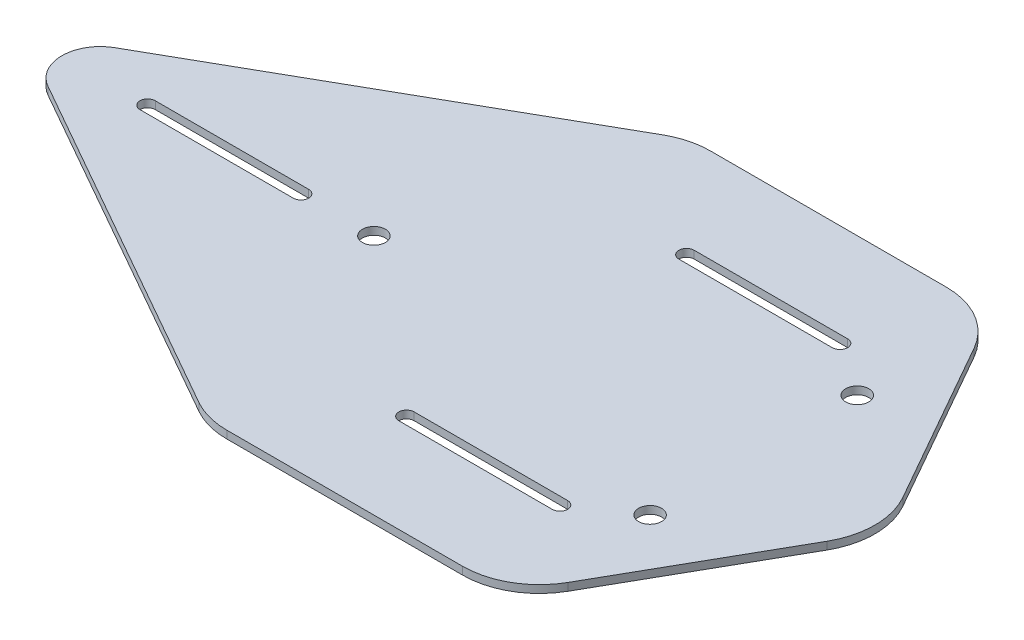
ISO-10303-21;
HEADER;
FILE_DESCRIPTION(('STEP AP214'),'2;1');
FILE_NAME('part.step','',(''),(''),'','','');
FILE_SCHEMA(('AUTOMOTIVE_DESIGN { 1 0 10303 214 1 1 1 1 }'));
ENDSEC;
DATA;
#1=APPLICATION_CONTEXT('core data for automotive mechanical design processes');
#2=APPLICATION_PROTOCOL_DEFINITION('international standard','automotive_design',2000,#1);
#3=PRODUCT_CONTEXT('',#1,'mechanical');
#4=PRODUCT('Part','Part','',(#3));
#5=PRODUCT_RELATED_PRODUCT_CATEGORY('part','',(#4));
#6=PRODUCT_DEFINITION_FORMATION('','',#4);
#7=PRODUCT_DEFINITION_CONTEXT('part definition',#1,'design');
#8=PRODUCT_DEFINITION('design','',#6,#7);
#9=PRODUCT_DEFINITION_SHAPE('','',#8);
#10=(LENGTH_UNIT() NAMED_UNIT(*) SI_UNIT(.MILLI.,.METRE.));
#11=(NAMED_UNIT(*) PLANE_ANGLE_UNIT() SI_UNIT($,.RADIAN.));
#12=(NAMED_UNIT(*) SI_UNIT($,.STERADIAN.) SOLID_ANGLE_UNIT());
#13=UNCERTAINTY_MEASURE_WITH_UNIT(LENGTH_MEASURE(1.E-05),#10,'distance_accuracy_value','');
#14=(GEOMETRIC_REPRESENTATION_CONTEXT(3) GLOBAL_UNCERTAINTY_ASSIGNED_CONTEXT((#13)) GLOBAL_UNIT_ASSIGNED_CONTEXT((#10,
#11,#12)) REPRESENTATION_CONTEXT('',''));
#15=CARTESIAN_POINT('',(0.,0.,0.));
#16=DIRECTION('',(0.,0.,1.));
#17=DIRECTION('',(1.,0.,0.));
#18=AXIS2_PLACEMENT_3D('',#15,#16,#17);
#19=CARTESIAN_POINT('',(-136.345922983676,2.,0.));
#20=DIRECTION('',(0.,1.,0.));
#21=DIRECTION('',(0.,0.,1.));
#22=AXIS2_PLACEMENT_3D('',#19,#20,#21);
#23=PLANE('',#22);
#24=CARTESIAN_POINT('',(34.,2.,27.));
#25=DIRECTION('',(0.,1.,0.));
#26=DIRECTION('',(0.,0.,-1.));
#27=AXIS2_PLACEMENT_3D('',#24,#25,#26);
#28=CIRCLE('',#27,2.99999999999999);
#29=CARTESIAN_POINT('',(34.,2.,24.));
#30=VERTEX_POINT('',#29);
#31=EDGE_CURVE('E706',#30,#30,#28,.T.);
#32=ORIENTED_EDGE('',*,*,#31,.F.);
#33=EDGE_LOOP('',(#32));
#34=FACE_BOUND('',#33,.T.);
#35=DIRECTION('',(1.,0.,0.));
#36=VECTOR('',#35,1.);
#37=CARTESIAN_POINT('',(-124.,2.,2.00000000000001));
#38=LINE('',#37,#36);
#39=CARTESIAN_POINT('',(-124.,2.,2.00000000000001));
#40=VERTEX_POINT('',#39);
#41=CARTESIAN_POINT('',(-84.,2.,2.));
#42=VERTEX_POINT('',#41);
#43=EDGE_CURVE('E202',#40,#42,#38,.T.);
#44=ORIENTED_EDGE('',*,*,#43,.F.);
#45=CARTESIAN_POINT('',(-124.,2.,0.));
#46=DIRECTION('',(0.,1.,0.));
#47=DIRECTION('',(0.,0.,1.));
#48=AXIS2_PLACEMENT_3D('',#45,#46,#47);
#49=CIRCLE('',#48,2.00000000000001);
#50=CARTESIAN_POINT('',(-124.,2.,-2.00000000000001));
#51=VERTEX_POINT('',#50);
#52=EDGE_CURVE('E194',#51,#40,#49,.T.);
#53=ORIENTED_EDGE('',*,*,#52,.F.);
#54=DIRECTION('',(-1.,0.,0.));
#55=VECTOR('',#54,1.);
#56=CARTESIAN_POINT('',(-124.,2.,-2.00000000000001));
#57=LINE('',#56,#55);
#58=CARTESIAN_POINT('',(-84.,2.,-2.00000000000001));
#59=VERTEX_POINT('',#58);
#60=EDGE_CURVE('E217',#59,#51,#57,.T.);
#61=ORIENTED_EDGE('',*,*,#60,.F.);
#62=CARTESIAN_POINT('',(-84.,2.,0.));
#63=DIRECTION('',(0.,1.,0.));
#64=DIRECTION('',(0.,0.,1.));
#65=AXIS2_PLACEMENT_3D('',#62,#63,#64);
#66=CIRCLE('',#65,2.00000000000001);
#67=EDGE_CURVE('E215',#42,#59,#66,.T.);
#68=ORIENTED_EDGE('',*,*,#67,.F.);
#69=EDGE_LOOP('',(#44,#53,#61,#68));
#70=FACE_BOUND('',#69,.T.);
#71=DIRECTION('',(-1.,0.,0.));
#72=VECTOR('',#71,1.);
#73=CARTESIAN_POINT('',(20.,2.,-38.5));
#74=LINE('',#73,#72);
#75=CARTESIAN_POINT('',(20.,2.,-38.5));
#76=VERTEX_POINT('',#75);
#77=CARTESIAN_POINT('',(-20.,2.,-38.5));
#78=VERTEX_POINT('',#77);
#79=EDGE_CURVE('E266',#76,#78,#74,.T.);
#80=ORIENTED_EDGE('',*,*,#79,.F.);
#81=CARTESIAN_POINT('',(20.,2.,-36.5));
#82=DIRECTION('',(0.,1.,0.));
#83=DIRECTION('',(0.,0.,1.));
#84=AXIS2_PLACEMENT_3D('',#81,#82,#83);
#85=CIRCLE('',#84,2.00000000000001);
#86=CARTESIAN_POINT('',(20.,2.,-34.5));
#87=VERTEX_POINT('',#86);
#88=EDGE_CURVE('E264',#87,#76,#85,.T.);
#89=ORIENTED_EDGE('',*,*,#88,.F.);
#90=DIRECTION('',(1.,0.,0.));
#91=VECTOR('',#90,1.);
#92=CARTESIAN_POINT('',(20.,2.,-34.5));
#93=LINE('',#92,#91);
#94=CARTESIAN_POINT('',(-20.,2.,-34.5));
#95=VERTEX_POINT('',#94);
#96=EDGE_CURVE('E272',#95,#87,#93,.T.);
#97=ORIENTED_EDGE('',*,*,#96,.F.);
#98=CARTESIAN_POINT('',(-20.,2.,-36.5));
#99=DIRECTION('',(0.,1.,0.));
#100=DIRECTION('',(0.,0.,1.));
#101=AXIS2_PLACEMENT_3D('',#98,#99,#100);
#102=CIRCLE('',#101,2.00000000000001);
#103=EDGE_CURVE('E269',#78,#95,#102,.T.);
#104=ORIENTED_EDGE('',*,*,#103,.F.);
#105=EDGE_LOOP('',(#80,#89,#97,#104));
#106=FACE_BOUND('',#105,.T.);
#107=CARTESIAN_POINT('',(-136.345922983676,2.,0.));
#108=DIRECTION('',(0.,1.,0.));
#109=DIRECTION('',(0.,0.,1.));
#110=AXIS2_PLACEMENT_3D('',#107,#108,#109);
#111=CIRCLE('',#110,10.);
#112=CARTESIAN_POINT('',(-141.284089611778,2.,-8.69566043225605));
#113=VERTEX_POINT('',#112);
#114=CARTESIAN_POINT('',(-141.284089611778,2.,8.69566043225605));
#115=VERTEX_POINT('',#114);
#116=EDGE_CURVE('E295',#113,#115,#111,.T.);
#117=ORIENTED_EDGE('',*,*,#116,.T.);
#118=DIRECTION('',(0.869566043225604,0.,0.493816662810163));
#119=VECTOR('',#118,1.);
#120=CARTESIAN_POINT('',(-141.284089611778,2.,8.69566043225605));
#121=LINE('',#120,#119);
#122=CARTESIAN_POINT('',(-50.1797595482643,2.,60.4327729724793));
#123=VERTEX_POINT('',#122);
#124=EDGE_CURVE('E298',#115,#123,#121,.T.);
#125=ORIENTED_EDGE('',*,*,#124,.T.);
#126=CARTESIAN_POINT('',(-40.3034262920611,2.,43.0414521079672));
#127=DIRECTION('',(0.,1.,0.));
#128=DIRECTION('',(0.,0.,1.));
#129=AXIS2_PLACEMENT_3D('',#126,#127,#128);
#130=CIRCLE('',#129,20.);
#131=CARTESIAN_POINT('',(-40.3034262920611,2.,63.0414521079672));
#132=VERTEX_POINT('',#131);
#133=EDGE_CURVE('E301',#123,#132,#130,.T.);
#134=ORIENTED_EDGE('',*,*,#133,.T.);
#135=DIRECTION('',(1.,0.,0.));
#136=VECTOR('',#135,1.);
#137=CARTESIAN_POINT('',(-40.3034262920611,2.,63.0414521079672));
#138=LINE('',#137,#136);
#139=CARTESIAN_POINT('',(21.17688950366,2.,63.0414521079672));
#140=VERTEX_POINT('',#139);
#141=EDGE_CURVE('E303',#132,#140,#138,.T.);
#142=ORIENTED_EDGE('',*,*,#141,.T.);
#143=CARTESIAN_POINT('',(21.17688950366,2.,43.0414521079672));
#144=DIRECTION('',(0.,1.,0.));
#145=DIRECTION('',(0.,0.,1.));
#146=AXIS2_PLACEMENT_3D('',#143,#144,#145);
#147=CIRCLE('',#146,20.);
#148=CARTESIAN_POINT('',(38.5682103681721,2.,52.9177853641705));
#149=VERTEX_POINT('',#148);
#150=EDGE_CURVE('E305',#140,#149,#147,.T.);
#151=ORIENTED_EDGE('',*,*,#150,.T.);
#152=DIRECTION('',(0.493816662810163,0.,-0.869566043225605));
#153=VECTOR('',#152,1.);
#154=CARTESIAN_POINT('',(38.5682103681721,2.,52.9177853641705));
#155=LINE('',#154,#153);
#156=CARTESIAN_POINT('',(63.0109613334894,2.,9.87633325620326));
#157=VERTEX_POINT('',#156);
#158=EDGE_CURVE('E307',#149,#157,#155,.T.);
#159=ORIENTED_EDGE('',*,*,#158,.T.);
#160=CARTESIAN_POINT('',(45.6196404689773,2.,0.));
#161=DIRECTION('',(0.,1.,0.));
#162=DIRECTION('',(0.,0.,1.));
#163=AXIS2_PLACEMENT_3D('',#160,#161,#162);
#164=CIRCLE('',#163,20.);
#165=CARTESIAN_POINT('',(63.0109613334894,2.,-9.87633325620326));
#166=VERTEX_POINT('',#165);
#167=EDGE_CURVE('E309',#157,#166,#164,.T.);
#168=ORIENTED_EDGE('',*,*,#167,.T.);
#169=DIRECTION('',(-0.493816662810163,0.,-0.869566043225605));
#170=VECTOR('',#169,1.);
#171=CARTESIAN_POINT('',(63.0109613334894,2.,-9.87633325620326));
#172=LINE('',#171,#170);
#173=CARTESIAN_POINT('',(38.5682103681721,2.,-52.9177853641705));
#174=VERTEX_POINT('',#173);
#175=EDGE_CURVE('E311',#166,#174,#172,.T.);
#176=ORIENTED_EDGE('',*,*,#175,.T.);
#177=CARTESIAN_POINT('',(21.17688950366,2.,-43.0414521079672));
#178=DIRECTION('',(0.,1.,0.));
#179=DIRECTION('',(0.,0.,1.));
#180=AXIS2_PLACEMENT_3D('',#177,#178,#179);
#181=CIRCLE('',#180,20.);
#182=CARTESIAN_POINT('',(21.17688950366,2.,-63.0414521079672));
#183=VERTEX_POINT('',#182);
#184=EDGE_CURVE('E313',#174,#183,#181,.T.);
#185=ORIENTED_EDGE('',*,*,#184,.T.);
#186=DIRECTION('',(-1.,0.,0.));
#187=VECTOR('',#186,1.);
#188=CARTESIAN_POINT('',(21.17688950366,2.,-63.0414521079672));
#189=LINE('',#188,#187);
#190=CARTESIAN_POINT('',(-40.3034262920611,2.,-63.0414521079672));
#191=VERTEX_POINT('',#190);
#192=EDGE_CURVE('E315',#183,#191,#189,.T.);
#193=ORIENTED_EDGE('',*,*,#192,.T.);
#194=CARTESIAN_POINT('',(-40.3034262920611,2.,-43.0414521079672));
#195=DIRECTION('',(0.,1.,0.));
#196=DIRECTION('',(0.,0.,-1.));
#197=AXIS2_PLACEMENT_3D('',#194,#195,#196);
#198=CIRCLE('',#197,20.);
#199=CARTESIAN_POINT('',(-50.1797595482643,2.,-60.4327729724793));
#200=VERTEX_POINT('',#199);
#201=EDGE_CURVE('E317',#191,#200,#198,.T.);
#202=ORIENTED_EDGE('',*,*,#201,.T.);
#203=DIRECTION('',(-0.869566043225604,0.,0.493816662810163));
#204=VECTOR('',#203,1.);
#205=CARTESIAN_POINT('',(-50.1797595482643,2.,-60.4327729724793));
#206=LINE('',#205,#204);
#207=EDGE_CURVE('E319',#200,#113,#206,.T.);
#208=ORIENTED_EDGE('',*,*,#207,.T.);
#209=EDGE_LOOP('',(#117,#125,#134,#142,#151,#159,#168,#176,#185,#193,#202,#208));
#210=FACE_BOUND('',#209,.T.);
#211=DIRECTION('',(-1.,0.,0.));
#212=VECTOR('',#211,1.);
#213=CARTESIAN_POINT('',(20.,2.,34.5));
#214=LINE('',#213,#212);
#215=CARTESIAN_POINT('',(20.,2.,34.5));
#216=VERTEX_POINT('',#215);
#217=CARTESIAN_POINT('',(-20.,2.,34.5));
#218=VERTEX_POINT('',#217);
#219=EDGE_CURVE('E235',#216,#218,#214,.T.);
#220=ORIENTED_EDGE('',*,*,#219,.F.);
#221=CARTESIAN_POINT('',(20.,2.,36.5));
#222=DIRECTION('',(0.,1.,0.));
#223=DIRECTION('',(0.,0.,1.));
#224=AXIS2_PLACEMENT_3D('',#221,#222,#223);
#225=CIRCLE('',#224,2.);
#226=CARTESIAN_POINT('',(20.,2.,38.5));
#227=VERTEX_POINT('',#226);
#228=EDGE_CURVE('E233',#227,#216,#225,.T.);
#229=ORIENTED_EDGE('',*,*,#228,.F.);
#230=DIRECTION('',(1.,0.,0.));
#231=VECTOR('',#230,1.);
#232=CARTESIAN_POINT('',(20.,2.,38.5));
#233=LINE('',#232,#231);
#234=CARTESIAN_POINT('',(-20.,2.,38.5));
#235=VERTEX_POINT('',#234);
#236=EDGE_CURVE('E241',#235,#227,#233,.T.);
#237=ORIENTED_EDGE('',*,*,#236,.F.);
#238=CARTESIAN_POINT('',(-20.,2.,36.5));
#239=DIRECTION('',(0.,1.,0.));
#240=DIRECTION('',(0.,0.,1.));
#241=AXIS2_PLACEMENT_3D('',#238,#239,#240);
#242=CIRCLE('',#241,2.);
#243=EDGE_CURVE('E238',#218,#235,#242,.T.);
#244=ORIENTED_EDGE('',*,*,#243,.F.);
#245=EDGE_LOOP('',(#220,#229,#237,#244));
#246=FACE_BOUND('',#245,.T.);
#247=CARTESIAN_POINT('',(-65.,2.,0.));
#248=DIRECTION('',(0.,1.,0.));
#249=DIRECTION('',(0.,0.,-1.));
#250=AXIS2_PLACEMENT_3D('',#247,#248,#249);
#251=CIRCLE('',#250,3.00000000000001);
#252=CARTESIAN_POINT('',(-65.,2.,-3.00000000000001));
#253=VERTEX_POINT('',#252);
#254=EDGE_CURVE('E223',#253,#253,#251,.T.);
#255=ORIENTED_EDGE('',*,*,#254,.F.);
#256=EDGE_LOOP('',(#255));
#257=FACE_BOUND('',#256,.T.);
#258=CARTESIAN_POINT('',(34.,2.,-27.));
#259=DIRECTION('',(0.,1.,0.));
#260=DIRECTION('',(0.,0.,-1.));
#261=AXIS2_PLACEMENT_3D('',#258,#259,#260);
#262=CIRCLE('',#261,2.99999999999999);
#263=CARTESIAN_POINT('',(34.,2.,-30.));
#264=VERTEX_POINT('',#263);
#265=EDGE_CURVE('E697',#264,#264,#262,.T.);
#266=ORIENTED_EDGE('',*,*,#265,.F.);
#267=EDGE_LOOP('',(#266));
#268=FACE_BOUND('',#267,.T.);
#269=ADVANCED_FACE('F33',(#34,#70,#106,#210,#246,#257,#268),#23,.T.);
#270=CARTESIAN_POINT('',(-136.345922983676,0.,0.));
#271=DIRECTION('',(0.,1.,0.));
#272=DIRECTION('',(0.,0.,1.));
#273=AXIS2_PLACEMENT_3D('',#270,#271,#272);
#274=PLANE('',#273);
#275=CARTESIAN_POINT('',(34.,0.,27.));
#276=DIRECTION('',(0.,1.,0.));
#277=DIRECTION('',(0.,0.,-1.));
#278=AXIS2_PLACEMENT_3D('',#275,#276,#277);
#279=CIRCLE('',#278,2.99999999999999);
#280=CARTESIAN_POINT('',(34.,0.,24.));
#281=VERTEX_POINT('',#280);
#282=EDGE_CURVE('E703',#281,#281,#279,.T.);
#283=ORIENTED_EDGE('',*,*,#282,.T.);
#284=EDGE_LOOP('',(#283));
#285=FACE_BOUND('',#284,.T.);
#286=CARTESIAN_POINT('',(-124.,0.,0.));
#287=DIRECTION('',(0.,1.,0.));
#288=DIRECTION('',(0.,0.,1.));
#289=AXIS2_PLACEMENT_3D('',#286,#287,#288);
#290=CIRCLE('',#289,2.00000000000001);
#291=CARTESIAN_POINT('',(-124.,0.,-2.00000000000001));
#292=VERTEX_POINT('',#291);
#293=CARTESIAN_POINT('',(-124.,0.,2.00000000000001));
#294=VERTEX_POINT('',#293);
#295=EDGE_CURVE('E56',#292,#294,#290,.T.);
#296=ORIENTED_EDGE('',*,*,#295,.T.);
#297=DIRECTION('',(1.,0.,0.));
#298=VECTOR('',#297,1.);
#299=CARTESIAN_POINT('',(-124.,0.,2.00000000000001));
#300=LINE('',#299,#298);
#301=CARTESIAN_POINT('',(-84.,0.,2.));
#302=VERTEX_POINT('',#301);
#303=EDGE_CURVE('E209',#294,#302,#300,.T.);
#304=ORIENTED_EDGE('',*,*,#303,.T.);
#305=CARTESIAN_POINT('',(-84.,0.,0.));
#306=DIRECTION('',(0.,1.,0.));
#307=DIRECTION('',(0.,0.,1.));
#308=AXIS2_PLACEMENT_3D('',#305,#306,#307);
#309=CIRCLE('',#308,2.00000000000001);
#310=CARTESIAN_POINT('',(-84.,0.,-2.00000000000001));
#311=VERTEX_POINT('',#310);
#312=EDGE_CURVE('E225',#302,#311,#309,.T.);
#313=ORIENTED_EDGE('',*,*,#312,.T.);
#314=DIRECTION('',(-1.,0.,0.));
#315=VECTOR('',#314,1.);
#316=CARTESIAN_POINT('',(-124.,0.,-2.00000000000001));
#317=LINE('',#316,#315);
#318=EDGE_CURVE('E203',#311,#292,#317,.T.);
#319=ORIENTED_EDGE('',*,*,#318,.T.);
#320=EDGE_LOOP('',(#296,#304,#313,#319));
#321=FACE_BOUND('',#320,.T.);
#322=CARTESIAN_POINT('',(20.,0.,-36.5));
#323=DIRECTION('',(0.,1.,0.));
#324=DIRECTION('',(0.,0.,1.));
#325=AXIS2_PLACEMENT_3D('',#322,#323,#324);
#326=CIRCLE('',#325,2.00000000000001);
#327=CARTESIAN_POINT('',(20.,0.,-34.5));
#328=VERTEX_POINT('',#327);
#329=CARTESIAN_POINT('',(20.,0.,-38.5));
#330=VERTEX_POINT('',#329);
#331=EDGE_CURVE('E263',#328,#330,#326,.T.);
#332=ORIENTED_EDGE('',*,*,#331,.T.);
#333=DIRECTION('',(-1.,0.,0.));
#334=VECTOR('',#333,1.);
#335=CARTESIAN_POINT('',(20.,0.,-38.5));
#336=LINE('',#335,#334);
#337=CARTESIAN_POINT('',(-20.,0.,-38.5));
#338=VERTEX_POINT('',#337);
#339=EDGE_CURVE('E277',#330,#338,#336,.T.);
#340=ORIENTED_EDGE('',*,*,#339,.T.);
#341=CARTESIAN_POINT('',(-20.,0.,-36.5));
#342=DIRECTION('',(0.,1.,0.));
#343=DIRECTION('',(0.,0.,1.));
#344=AXIS2_PLACEMENT_3D('',#341,#342,#343);
#345=CIRCLE('',#344,2.00000000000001);
#346=CARTESIAN_POINT('',(-20.,0.,-34.5));
#347=VERTEX_POINT('',#346);
#348=EDGE_CURVE('E280',#338,#347,#345,.T.);
#349=ORIENTED_EDGE('',*,*,#348,.T.);
#350=DIRECTION('',(1.,0.,0.));
#351=VECTOR('',#350,1.);
#352=CARTESIAN_POINT('',(20.,0.,-34.5));
#353=LINE('',#352,#351);
#354=EDGE_CURVE('E267',#347,#328,#353,.T.);
#355=ORIENTED_EDGE('',*,*,#354,.T.);
#356=EDGE_LOOP('',(#332,#340,#349,#355));
#357=FACE_BOUND('',#356,.T.);
#358=CARTESIAN_POINT('',(-136.345922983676,0.,0.));
#359=DIRECTION('',(0.,1.,0.));
#360=DIRECTION('',(0.,0.,1.));
#361=AXIS2_PLACEMENT_3D('',#358,#359,#360);
#362=CIRCLE('',#361,10.);
#363=CARTESIAN_POINT('',(-141.284089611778,0.,-8.69566043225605));
#364=VERTEX_POINT('',#363);
#365=CARTESIAN_POINT('',(-141.284089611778,0.,8.69566043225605));
#366=VERTEX_POINT('',#365);
#367=EDGE_CURVE('E294',#364,#366,#362,.T.);
#368=ORIENTED_EDGE('',*,*,#367,.F.);
#369=DIRECTION('',(-0.869566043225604,0.,0.493816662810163));
#370=VECTOR('',#369,1.);
#371=CARTESIAN_POINT('',(-50.1797595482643,0.,-60.4327729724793));
#372=LINE('',#371,#370);
#373=CARTESIAN_POINT('',(-50.1797595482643,0.,-60.4327729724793));
#374=VERTEX_POINT('',#373);
#375=EDGE_CURVE('E299',#374,#364,#372,.T.);
#376=ORIENTED_EDGE('',*,*,#375,.F.);
#377=CARTESIAN_POINT('',(-40.3034262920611,0.,-43.0414521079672));
#378=DIRECTION('',(0.,1.,0.));
#379=DIRECTION('',(0.,0.,-1.));
#380=AXIS2_PLACEMENT_3D('',#377,#378,#379);
#381=CIRCLE('',#380,20.);
#382=CARTESIAN_POINT('',(-40.3034262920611,0.,-63.0414521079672));
#383=VERTEX_POINT('',#382);
#384=EDGE_CURVE('E342',#383,#374,#381,.T.);
#385=ORIENTED_EDGE('',*,*,#384,.F.);
#386=DIRECTION('',(-1.,0.,0.));
#387=VECTOR('',#386,1.);
#388=CARTESIAN_POINT('',(21.17688950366,0.,-63.0414521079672));
#389=LINE('',#388,#387);
#390=CARTESIAN_POINT('',(21.17688950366,0.,-63.0414521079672));
#391=VERTEX_POINT('',#390);
#392=EDGE_CURVE('E340',#391,#383,#389,.T.);
#393=ORIENTED_EDGE('',*,*,#392,.F.);
#394=CARTESIAN_POINT('',(21.17688950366,0.,-43.0414521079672));
#395=DIRECTION('',(0.,1.,0.));
#396=DIRECTION('',(0.,0.,1.));
#397=AXIS2_PLACEMENT_3D('',#394,#395,#396);
#398=CIRCLE('',#397,20.);
#399=CARTESIAN_POINT('',(38.5682103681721,0.,-52.9177853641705));
#400=VERTEX_POINT('',#399);
#401=EDGE_CURVE('E338',#400,#391,#398,.T.);
#402=ORIENTED_EDGE('',*,*,#401,.F.);
#403=DIRECTION('',(-0.493816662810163,0.,-0.869566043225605));
#404=VECTOR('',#403,1.);
#405=CARTESIAN_POINT('',(63.0109613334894,0.,-9.87633325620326));
#406=LINE('',#405,#404);
#407=CARTESIAN_POINT('',(63.0109613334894,0.,-9.87633325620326));
#408=VERTEX_POINT('',#407);
#409=EDGE_CURVE('E336',#408,#400,#406,.T.);
#410=ORIENTED_EDGE('',*,*,#409,.F.);
#411=CARTESIAN_POINT('',(45.6196404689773,0.,0.));
#412=DIRECTION('',(0.,1.,0.));
#413=DIRECTION('',(0.,0.,1.));
#414=AXIS2_PLACEMENT_3D('',#411,#412,#413);
#415=CIRCLE('',#414,20.);
#416=CARTESIAN_POINT('',(63.0109613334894,0.,9.87633325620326));
#417=VERTEX_POINT('',#416);
#418=EDGE_CURVE('E334',#417,#408,#415,.T.);
#419=ORIENTED_EDGE('',*,*,#418,.F.);
#420=DIRECTION('',(0.493816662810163,0.,-0.869566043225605));
#421=VECTOR('',#420,1.);
#422=CARTESIAN_POINT('',(38.5682103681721,0.,52.9177853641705));
#423=LINE('',#422,#421);
#424=CARTESIAN_POINT('',(38.5682103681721,0.,52.9177853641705));
#425=VERTEX_POINT('',#424);
#426=EDGE_CURVE('E332',#425,#417,#423,.T.);
#427=ORIENTED_EDGE('',*,*,#426,.F.);
#428=CARTESIAN_POINT('',(21.17688950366,0.,43.0414521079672));
#429=DIRECTION('',(0.,1.,0.));
#430=DIRECTION('',(0.,0.,1.));
#431=AXIS2_PLACEMENT_3D('',#428,#429,#430);
#432=CIRCLE('',#431,20.);
#433=CARTESIAN_POINT('',(21.17688950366,0.,63.0414521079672));
#434=VERTEX_POINT('',#433);
#435=EDGE_CURVE('E330',#434,#425,#432,.T.);
#436=ORIENTED_EDGE('',*,*,#435,.F.);
#437=DIRECTION('',(1.,0.,0.));
#438=VECTOR('',#437,1.);
#439=CARTESIAN_POINT('',(-40.3034262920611,0.,63.0414521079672));
#440=LINE('',#439,#438);
#441=CARTESIAN_POINT('',(-40.3034262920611,0.,63.0414521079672));
#442=VERTEX_POINT('',#441);
#443=EDGE_CURVE('E328',#442,#434,#440,.T.);
#444=ORIENTED_EDGE('',*,*,#443,.F.);
#445=CARTESIAN_POINT('',(-40.3034262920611,0.,43.0414521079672));
#446=DIRECTION('',(0.,1.,0.));
#447=DIRECTION('',(0.,0.,1.));
#448=AXIS2_PLACEMENT_3D('',#445,#446,#447);
#449=CIRCLE('',#448,20.);
#450=CARTESIAN_POINT('',(-50.1797595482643,0.,60.4327729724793));
#451=VERTEX_POINT('',#450);
#452=EDGE_CURVE('E326',#451,#442,#449,.T.);
#453=ORIENTED_EDGE('',*,*,#452,.F.);
#454=DIRECTION('',(0.869566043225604,0.,0.493816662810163));
#455=VECTOR('',#454,1.);
#456=CARTESIAN_POINT('',(-141.284089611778,0.,8.69566043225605));
#457=LINE('',#456,#455);
#458=EDGE_CURVE('E324',#366,#451,#457,.T.);
#459=ORIENTED_EDGE('',*,*,#458,.F.);
#460=EDGE_LOOP('',(#368,#376,#385,#393,#402,#410,#419,#427,#436,#444,#453,#459));
#461=FACE_BOUND('',#460,.T.);
#462=CARTESIAN_POINT('',(20.,0.,36.5));
#463=DIRECTION('',(0.,1.,0.));
#464=DIRECTION('',(0.,0.,1.));
#465=AXIS2_PLACEMENT_3D('',#462,#463,#464);
#466=CIRCLE('',#465,2.);
#467=CARTESIAN_POINT('',(20.,0.,38.5));
#468=VERTEX_POINT('',#467);
#469=CARTESIAN_POINT('',(20.,0.,34.5));
#470=VERTEX_POINT('',#469);
#471=EDGE_CURVE('E210',#468,#470,#466,.T.);
#472=ORIENTED_EDGE('',*,*,#471,.T.);
#473=DIRECTION('',(-1.,0.,0.));
#474=VECTOR('',#473,1.);
#475=CARTESIAN_POINT('',(20.,0.,34.5));
#476=LINE('',#475,#474);
#477=CARTESIAN_POINT('',(-20.,0.,34.5));
#478=VERTEX_POINT('',#477);
#479=EDGE_CURVE('E246',#470,#478,#476,.T.);
#480=ORIENTED_EDGE('',*,*,#479,.T.);
#481=CARTESIAN_POINT('',(-20.,0.,36.5));
#482=DIRECTION('',(0.,1.,0.));
#483=DIRECTION('',(0.,0.,1.));
#484=AXIS2_PLACEMENT_3D('',#481,#482,#483);
#485=CIRCLE('',#484,2.);
#486=CARTESIAN_POINT('',(-20.,0.,38.5));
#487=VERTEX_POINT('',#486);
#488=EDGE_CURVE('E249',#478,#487,#485,.T.);
#489=ORIENTED_EDGE('',*,*,#488,.T.);
#490=DIRECTION('',(1.,0.,0.));
#491=VECTOR('',#490,1.);
#492=CARTESIAN_POINT('',(20.,0.,38.5));
#493=LINE('',#492,#491);
#494=EDGE_CURVE('E236',#487,#468,#493,.T.);
#495=ORIENTED_EDGE('',*,*,#494,.T.);
#496=EDGE_LOOP('',(#472,#480,#489,#495));
#497=FACE_BOUND('',#496,.T.);
#498=CARTESIAN_POINT('',(-65.,0.,0.));
#499=DIRECTION('',(0.,1.,0.));
#500=DIRECTION('',(0.,0.,-1.));
#501=AXIS2_PLACEMENT_3D('',#498,#499,#500);
#502=CIRCLE('',#501,3.00000000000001);
#503=CARTESIAN_POINT('',(-65.,0.,-3.00000000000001));
#504=VERTEX_POINT('',#503);
#505=EDGE_CURVE('E709',#504,#504,#502,.T.);
#506=ORIENTED_EDGE('',*,*,#505,.T.);
#507=EDGE_LOOP('',(#506));
#508=FACE_BOUND('',#507,.T.);
#509=CARTESIAN_POINT('',(34.,0.,-27.));
#510=DIRECTION('',(0.,1.,0.));
#511=DIRECTION('',(0.,0.,-1.));
#512=AXIS2_PLACEMENT_3D('',#509,#510,#511);
#513=CIRCLE('',#512,2.99999999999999);
#514=CARTESIAN_POINT('',(34.,0.,-30.));
#515=VERTEX_POINT('',#514);
#516=EDGE_CURVE('E700',#515,#515,#513,.T.);
#517=ORIENTED_EDGE('',*,*,#516,.T.);
#518=EDGE_LOOP('',(#517));
#519=FACE_BOUND('',#518,.T.);
#520=ADVANCED_FACE('F384',(#285,#321,#357,#461,#497,#508,#519),#274,.F.);
#521=CARTESIAN_POINT('',(-136.345922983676,2.,0.));
#522=DIRECTION('',(0.,-1.,0.));
#523=DIRECTION('',(0.,0.,-1.));
#524=AXIS2_PLACEMENT_3D('',#521,#522,#523);
#525=CYLINDRICAL_SURFACE('',#524,10.);
#526=ORIENTED_EDGE('',*,*,#367,.T.);
#527=DIRECTION('',(0.,-1.,0.));
#528=VECTOR('',#527,1.);
#529=CARTESIAN_POINT('',(-141.284089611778,2.,8.69566043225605));
#530=LINE('',#529,#528);
#531=EDGE_CURVE('E11',#115,#366,#530,.T.);
#532=ORIENTED_EDGE('',*,*,#531,.F.);
#533=ORIENTED_EDGE('',*,*,#116,.F.);
#534=DIRECTION('',(0.,-1.,0.));
#535=VECTOR('',#534,1.);
#536=CARTESIAN_POINT('',(-141.284089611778,2.,-8.69566043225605));
#537=LINE('',#536,#535);
#538=EDGE_CURVE('E321',#113,#364,#537,.T.);
#539=ORIENTED_EDGE('',*,*,#538,.T.);
#540=EDGE_LOOP('',(#526,#532,#533,#539));
#541=FACE_BOUND('',#540,.T.);
#542=ADVANCED_FACE('F35',(#541),#525,.T.);
#543=CARTESIAN_POINT('',(-141.284089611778,2.,8.69566043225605));
#544=DIRECTION('',(0.493816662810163,0.,-0.869566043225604));
#545=DIRECTION('',(-0.869566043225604,0.,-0.493816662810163));
#546=AXIS2_PLACEMENT_3D('',#543,#544,#545);
#547=PLANE('',#546);
#548=ORIENTED_EDGE('',*,*,#458,.T.);
#549=DIRECTION('',(0.,-1.,0.));
#550=VECTOR('',#549,1.);
#551=CARTESIAN_POINT('',(-50.1797595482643,2.,60.4327729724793));
#552=LINE('',#551,#550);
#553=EDGE_CURVE('E41',#123,#451,#552,.T.);
#554=ORIENTED_EDGE('',*,*,#553,.F.);
#555=ORIENTED_EDGE('',*,*,#124,.F.);
#556=ORIENTED_EDGE('',*,*,#531,.T.);
#557=EDGE_LOOP('',(#548,#554,#555,#556));
#558=FACE_BOUND('',#557,.T.);
#559=ADVANCED_FACE('F402',(#558),#547,.F.);
#560=CARTESIAN_POINT('',(-40.3034262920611,2.,43.0414521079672));
#561=DIRECTION('',(0.,-1.,0.));
#562=DIRECTION('',(0.,0.,-1.));
#563=AXIS2_PLACEMENT_3D('',#560,#561,#562);
#564=CYLINDRICAL_SURFACE('',#563,20.);
#565=ORIENTED_EDGE('',*,*,#452,.T.);
#566=DIRECTION('',(0.,-1.,0.));
#567=VECTOR('',#566,1.);
#568=CARTESIAN_POINT('',(-40.3034262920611,2.,63.0414521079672));
#569=LINE('',#568,#567);
#570=EDGE_CURVE('E371',#132,#442,#569,.T.);
#571=ORIENTED_EDGE('',*,*,#570,.F.);
#572=ORIENTED_EDGE('',*,*,#133,.F.);
#573=ORIENTED_EDGE('',*,*,#553,.T.);
#574=EDGE_LOOP('',(#565,#571,#572,#573));
#575=FACE_BOUND('',#574,.T.);
#576=ADVANCED_FACE('F378',(#575),#564,.T.);
#577=CARTESIAN_POINT('',(-40.3034262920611,2.,63.0414521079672));
#578=DIRECTION('',(0.,0.,-1.));
#579=DIRECTION('',(-1.,0.,0.));
#580=AXIS2_PLACEMENT_3D('',#577,#578,#579);
#581=PLANE('',#580);
#582=ORIENTED_EDGE('',*,*,#443,.T.);
#583=DIRECTION('',(0.,-1.,0.));
#584=VECTOR('',#583,1.);
#585=CARTESIAN_POINT('',(21.17688950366,2.,63.0414521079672));
#586=LINE('',#585,#584);
#587=EDGE_CURVE('E368',#140,#434,#586,.T.);
#588=ORIENTED_EDGE('',*,*,#587,.F.);
#589=ORIENTED_EDGE('',*,*,#141,.F.);
#590=ORIENTED_EDGE('',*,*,#570,.T.);
#591=EDGE_LOOP('',(#582,#588,#589,#590));
#592=FACE_BOUND('',#591,.T.);
#593=ADVANCED_FACE('F390',(#592),#581,.F.);
#594=CARTESIAN_POINT('',(21.17688950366,2.,43.0414521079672));
#595=DIRECTION('',(0.,-1.,0.));
#596=DIRECTION('',(0.,0.,-1.));
#597=AXIS2_PLACEMENT_3D('',#594,#595,#596);
#598=CYLINDRICAL_SURFACE('',#597,20.);
#599=ORIENTED_EDGE('',*,*,#435,.T.);
#600=DIRECTION('',(0.,-1.,0.));
#601=VECTOR('',#600,1.);
#602=CARTESIAN_POINT('',(38.5682103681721,2.,52.9177853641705));
#603=LINE('',#602,#601);
#604=EDGE_CURVE('E365',#149,#425,#603,.T.);
#605=ORIENTED_EDGE('',*,*,#604,.F.);
#606=ORIENTED_EDGE('',*,*,#150,.F.);
#607=ORIENTED_EDGE('',*,*,#587,.T.);
#608=EDGE_LOOP('',(#599,#605,#606,#607));
#609=FACE_BOUND('',#608,.T.);
#610=ADVANCED_FACE('F394',(#609),#598,.T.);
#611=CARTESIAN_POINT('',(38.5682103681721,2.,52.9177853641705));
#612=DIRECTION('',(-0.869566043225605,0.,-0.493816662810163));
#613=DIRECTION('',(-0.493816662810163,0.,0.869566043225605));
#614=AXIS2_PLACEMENT_3D('',#611,#612,#613);
#615=PLANE('',#614);
#616=ORIENTED_EDGE('',*,*,#426,.T.);
#617=DIRECTION('',(0.,-1.,0.));
#618=VECTOR('',#617,1.);
#619=CARTESIAN_POINT('',(63.0109613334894,2.,9.87633325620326));
#620=LINE('',#619,#618);
#621=EDGE_CURVE('E362',#157,#417,#620,.T.);
#622=ORIENTED_EDGE('',*,*,#621,.F.);
#623=ORIENTED_EDGE('',*,*,#158,.F.);
#624=ORIENTED_EDGE('',*,*,#604,.T.);
#625=EDGE_LOOP('',(#616,#622,#623,#624));
#626=FACE_BOUND('',#625,.T.);
#627=ADVANCED_FACE('F435',(#626),#615,.F.);
#628=CARTESIAN_POINT('',(45.6196404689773,2.,0.));
#629=DIRECTION('',(0.,-1.,0.));
#630=DIRECTION('',(0.,0.,-1.));
#631=AXIS2_PLACEMENT_3D('',#628,#629,#630);
#632=CYLINDRICAL_SURFACE('',#631,20.);
#633=ORIENTED_EDGE('',*,*,#418,.T.);
#634=DIRECTION('',(0.,-1.,0.));
#635=VECTOR('',#634,1.);
#636=CARTESIAN_POINT('',(63.0109613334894,2.,-9.87633325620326));
#637=LINE('',#636,#635);
#638=EDGE_CURVE('E359',#166,#408,#637,.T.);
#639=ORIENTED_EDGE('',*,*,#638,.F.);
#640=ORIENTED_EDGE('',*,*,#167,.F.);
#641=ORIENTED_EDGE('',*,*,#621,.T.);
#642=EDGE_LOOP('',(#633,#639,#640,#641));
#643=FACE_BOUND('',#642,.T.);
#644=ADVANCED_FACE('F433',(#643),#632,.T.);
#645=CARTESIAN_POINT('',(63.0109613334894,2.,-9.87633325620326));
#646=DIRECTION('',(-0.869566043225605,0.,0.493816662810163));
#647=DIRECTION('',(0.493816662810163,0.,0.869566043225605));
#648=AXIS2_PLACEMENT_3D('',#645,#646,#647);
#649=PLANE('',#648);
#650=ORIENTED_EDGE('',*,*,#409,.T.);
#651=DIRECTION('',(0.,-1.,0.));
#652=VECTOR('',#651,1.);
#653=CARTESIAN_POINT('',(38.5682103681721,2.,-52.9177853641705));
#654=LINE('',#653,#652);
#655=EDGE_CURVE('E356',#174,#400,#654,.T.);
#656=ORIENTED_EDGE('',*,*,#655,.F.);
#657=ORIENTED_EDGE('',*,*,#175,.F.);
#658=ORIENTED_EDGE('',*,*,#638,.T.);
#659=EDGE_LOOP('',(#650,#656,#657,#658));
#660=FACE_BOUND('',#659,.T.);
#661=ADVANCED_FACE('F429',(#660),#649,.F.);
#662=CARTESIAN_POINT('',(21.17688950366,2.,-43.0414521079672));
#663=DIRECTION('',(0.,-1.,0.));
#664=DIRECTION('',(0.,0.,-1.));
#665=AXIS2_PLACEMENT_3D('',#662,#663,#664);
#666=CYLINDRICAL_SURFACE('',#665,20.);
#667=ORIENTED_EDGE('',*,*,#401,.T.);
#668=DIRECTION('',(0.,-1.,0.));
#669=VECTOR('',#668,1.);
#670=CARTESIAN_POINT('',(21.17688950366,2.,-63.0414521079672));
#671=LINE('',#670,#669);
#672=EDGE_CURVE('E353',#183,#391,#671,.T.);
#673=ORIENTED_EDGE('',*,*,#672,.F.);
#674=ORIENTED_EDGE('',*,*,#184,.F.);
#675=ORIENTED_EDGE('',*,*,#655,.T.);
#676=EDGE_LOOP('',(#667,#673,#674,#675));
#677=FACE_BOUND('',#676,.T.);
#678=ADVANCED_FACE('F424',(#677),#666,.T.);
#679=CARTESIAN_POINT('',(21.17688950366,2.,-63.0414521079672));
#680=DIRECTION('',(0.,0.,1.));
#681=DIRECTION('',(1.,0.,0.));
#682=AXIS2_PLACEMENT_3D('',#679,#680,#681);
#683=PLANE('',#682);
#684=ORIENTED_EDGE('',*,*,#392,.T.);
#685=DIRECTION('',(0.,-1.,0.));
#686=VECTOR('',#685,1.);
#687=CARTESIAN_POINT('',(-40.3034262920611,2.,-63.0414521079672));
#688=LINE('',#687,#686);
#689=EDGE_CURVE('E350',#191,#383,#688,.T.);
#690=ORIENTED_EDGE('',*,*,#689,.F.);
#691=ORIENTED_EDGE('',*,*,#192,.F.);
#692=ORIENTED_EDGE('',*,*,#672,.T.);
#693=EDGE_LOOP('',(#684,#690,#691,#692));
#694=FACE_BOUND('',#693,.T.);
#695=ADVANCED_FACE('F418',(#694),#683,.F.);
#696=CARTESIAN_POINT('',(-40.3034262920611,2.,-43.0414521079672));
#697=DIRECTION('',(0.,-1.,0.));
#698=DIRECTION('',(0.,0.,-1.));
#699=AXIS2_PLACEMENT_3D('',#696,#697,#698);
#700=CYLINDRICAL_SURFACE('',#699,20.);
#701=ORIENTED_EDGE('',*,*,#384,.T.);
#702=DIRECTION('',(0.,-1.,0.));
#703=VECTOR('',#702,1.);
#704=CARTESIAN_POINT('',(-50.1797595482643,2.,-60.4327729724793));
#705=LINE('',#704,#703);
#706=EDGE_CURVE('E347',#200,#374,#705,.T.);
#707=ORIENTED_EDGE('',*,*,#706,.F.);
#708=ORIENTED_EDGE('',*,*,#201,.F.);
#709=ORIENTED_EDGE('',*,*,#689,.T.);
#710=EDGE_LOOP('',(#701,#707,#708,#709));
#711=FACE_BOUND('',#710,.T.);
#712=ADVANCED_FACE('F414',(#711),#700,.T.);
#713=CARTESIAN_POINT('',(-50.1797595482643,2.,-60.4327729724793));
#714=DIRECTION('',(0.493816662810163,0.,0.869566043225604));
#715=DIRECTION('',(0.869566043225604,0.,-0.493816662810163));
#716=AXIS2_PLACEMENT_3D('',#713,#714,#715);
#717=PLANE('',#716);
#718=ORIENTED_EDGE('',*,*,#375,.T.);
#719=ORIENTED_EDGE('',*,*,#538,.F.);
#720=ORIENTED_EDGE('',*,*,#207,.F.);
#721=ORIENTED_EDGE('',*,*,#706,.T.);
#722=EDGE_LOOP('',(#718,#719,#720,#721));
#723=FACE_BOUND('',#722,.T.);
#724=ADVANCED_FACE('F409',(#723),#717,.F.);
#725=CARTESIAN_POINT('',(20.,2.,-36.5));
#726=DIRECTION('',(0.,-1.,0.));
#727=DIRECTION('',(0.,0.,-1.));
#728=AXIS2_PLACEMENT_3D('',#725,#726,#727);
#729=CYLINDRICAL_SURFACE('',#728,2.00000000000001);
#730=ORIENTED_EDGE('',*,*,#331,.F.);
#731=DIRECTION('',(0.,-1.,0.));
#732=VECTOR('',#731,1.);
#733=CARTESIAN_POINT('',(20.,2.,-34.5));
#734=LINE('',#733,#732);
#735=EDGE_CURVE('E274',#87,#328,#734,.T.);
#736=ORIENTED_EDGE('',*,*,#735,.F.);
#737=ORIENTED_EDGE('',*,*,#88,.T.);
#738=DIRECTION('',(0.,-1.,0.));
#739=VECTOR('',#738,1.);
#740=CARTESIAN_POINT('',(20.,2.,-38.5));
#741=LINE('',#740,#739);
#742=EDGE_CURVE('E291',#76,#330,#741,.T.);
#743=ORIENTED_EDGE('',*,*,#742,.T.);
#744=EDGE_LOOP('',(#730,#736,#737,#743));
#745=FACE_BOUND('',#744,.T.);
#746=ADVANCED_FACE('F454',(#745),#729,.F.);
#747=CARTESIAN_POINT('',(20.,2.,-38.5));
#748=DIRECTION('',(0.,0.,1.));
#749=DIRECTION('',(1.,0.,0.));
#750=AXIS2_PLACEMENT_3D('',#747,#748,#749);
#751=PLANE('',#750);
#752=ORIENTED_EDGE('',*,*,#339,.F.);
#753=ORIENTED_EDGE('',*,*,#742,.F.);
#754=ORIENTED_EDGE('',*,*,#79,.T.);
#755=DIRECTION('',(0.,-1.,0.));
#756=VECTOR('',#755,1.);
#757=CARTESIAN_POINT('',(-20.,2.,-38.5));
#758=LINE('',#757,#756);
#759=EDGE_CURVE('E289',#78,#338,#758,.T.);
#760=ORIENTED_EDGE('',*,*,#759,.T.);
#761=EDGE_LOOP('',(#752,#753,#754,#760));
#762=FACE_BOUND('',#761,.T.);
#763=ADVANCED_FACE('F492',(#762),#751,.T.);
#764=CARTESIAN_POINT('',(-20.,2.,-36.5));
#765=DIRECTION('',(0.,-1.,0.));
#766=DIRECTION('',(0.,0.,-1.));
#767=AXIS2_PLACEMENT_3D('',#764,#765,#766);
#768=CYLINDRICAL_SURFACE('',#767,2.00000000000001);
#769=ORIENTED_EDGE('',*,*,#348,.F.);
#770=ORIENTED_EDGE('',*,*,#759,.F.);
#771=ORIENTED_EDGE('',*,*,#103,.T.);
#772=DIRECTION('',(0.,-1.,0.));
#773=VECTOR('',#772,1.);
#774=CARTESIAN_POINT('',(-20.,2.,-34.5));
#775=LINE('',#774,#773);
#776=EDGE_CURVE('E287',#95,#347,#775,.T.);
#777=ORIENTED_EDGE('',*,*,#776,.T.);
#778=EDGE_LOOP('',(#769,#770,#771,#777));
#779=FACE_BOUND('',#778,.T.);
#780=ADVANCED_FACE('F499',(#779),#768,.F.);
#781=CARTESIAN_POINT('',(20.,2.,-34.5));
#782=DIRECTION('',(0.,0.,-1.));
#783=DIRECTION('',(-1.,0.,0.));
#784=AXIS2_PLACEMENT_3D('',#781,#782,#783);
#785=PLANE('',#784);
#786=ORIENTED_EDGE('',*,*,#354,.F.);
#787=ORIENTED_EDGE('',*,*,#776,.F.);
#788=ORIENTED_EDGE('',*,*,#96,.T.);
#789=ORIENTED_EDGE('',*,*,#735,.T.);
#790=EDGE_LOOP('',(#786,#787,#788,#789));
#791=FACE_BOUND('',#790,.T.);
#792=ADVANCED_FACE('F506',(#791),#785,.T.);
#793=CARTESIAN_POINT('',(20.,2.,36.5));
#794=DIRECTION('',(0.,-1.,0.));
#795=DIRECTION('',(0.,0.,-1.));
#796=AXIS2_PLACEMENT_3D('',#793,#794,#795);
#797=CYLINDRICAL_SURFACE('',#796,2.);
#798=ORIENTED_EDGE('',*,*,#471,.F.);
#799=DIRECTION('',(0.,-1.,0.));
#800=VECTOR('',#799,1.);
#801=CARTESIAN_POINT('',(20.,2.,38.5));
#802=LINE('',#801,#800);
#803=EDGE_CURVE('E243',#227,#468,#802,.T.);
#804=ORIENTED_EDGE('',*,*,#803,.F.);
#805=ORIENTED_EDGE('',*,*,#228,.T.);
#806=DIRECTION('',(0.,-1.,0.));
#807=VECTOR('',#806,1.);
#808=CARTESIAN_POINT('',(20.,2.,34.5));
#809=LINE('',#808,#807);
#810=EDGE_CURVE('E260',#216,#470,#809,.T.);
#811=ORIENTED_EDGE('',*,*,#810,.T.);
#812=EDGE_LOOP('',(#798,#804,#805,#811));
#813=FACE_BOUND('',#812,.T.);
#814=ADVANCED_FACE('F514',(#813),#797,.F.);
#815=CARTESIAN_POINT('',(20.,2.,34.5));
#816=DIRECTION('',(0.,0.,1.));
#817=DIRECTION('',(1.,0.,0.));
#818=AXIS2_PLACEMENT_3D('',#815,#816,#817);
#819=PLANE('',#818);
#820=ORIENTED_EDGE('',*,*,#479,.F.);
#821=ORIENTED_EDGE('',*,*,#810,.F.);
#822=ORIENTED_EDGE('',*,*,#219,.T.);
#823=DIRECTION('',(0.,-1.,0.));
#824=VECTOR('',#823,1.);
#825=CARTESIAN_POINT('',(-20.,2.,34.5));
#826=LINE('',#825,#824);
#827=EDGE_CURVE('E258',#218,#478,#826,.T.);
#828=ORIENTED_EDGE('',*,*,#827,.T.);
#829=EDGE_LOOP('',(#820,#821,#822,#828));
#830=FACE_BOUND('',#829,.T.);
#831=ADVANCED_FACE('F522',(#830),#819,.T.);
#832=CARTESIAN_POINT('',(-20.,2.,36.5));
#833=DIRECTION('',(0.,-1.,0.));
#834=DIRECTION('',(0.,0.,-1.));
#835=AXIS2_PLACEMENT_3D('',#832,#833,#834);
#836=CYLINDRICAL_SURFACE('',#835,2.);
#837=ORIENTED_EDGE('',*,*,#488,.F.);
#838=ORIENTED_EDGE('',*,*,#827,.F.);
#839=ORIENTED_EDGE('',*,*,#243,.T.);
#840=DIRECTION('',(0.,-1.,0.));
#841=VECTOR('',#840,1.);
#842=CARTESIAN_POINT('',(-20.,2.,38.5));
#843=LINE('',#842,#841);
#844=EDGE_CURVE('E256',#235,#487,#843,.T.);
#845=ORIENTED_EDGE('',*,*,#844,.T.);
#846=EDGE_LOOP('',(#837,#838,#839,#845));
#847=FACE_BOUND('',#846,.T.);
#848=ADVANCED_FACE('F530',(#847),#836,.F.);
#849=CARTESIAN_POINT('',(20.,2.,38.5));
#850=DIRECTION('',(0.,0.,-1.));
#851=DIRECTION('',(-1.,0.,0.));
#852=AXIS2_PLACEMENT_3D('',#849,#850,#851);
#853=PLANE('',#852);
#854=ORIENTED_EDGE('',*,*,#494,.F.);
#855=ORIENTED_EDGE('',*,*,#844,.F.);
#856=ORIENTED_EDGE('',*,*,#236,.T.);
#857=ORIENTED_EDGE('',*,*,#803,.T.);
#858=EDGE_LOOP('',(#854,#855,#856,#857));
#859=FACE_BOUND('',#858,.T.);
#860=ADVANCED_FACE('F538',(#859),#853,.T.);
#861=CARTESIAN_POINT('',(-124.,2.,0.));
#862=DIRECTION('',(0.,-1.,0.));
#863=DIRECTION('',(0.,0.,-1.));
#864=AXIS2_PLACEMENT_3D('',#861,#862,#863);
#865=CYLINDRICAL_SURFACE('',#864,2.00000000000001);
#866=ORIENTED_EDGE('',*,*,#295,.F.);
#867=DIRECTION('',(0.,-1.,0.));
#868=VECTOR('',#867,1.);
#869=CARTESIAN_POINT('',(-124.,2.,-2.00000000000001));
#870=LINE('',#869,#868);
#871=EDGE_CURVE('E198',#51,#292,#870,.T.);
#872=ORIENTED_EDGE('',*,*,#871,.F.);
#873=ORIENTED_EDGE('',*,*,#52,.T.);
#874=DIRECTION('',(0.,-1.,0.));
#875=VECTOR('',#874,1.);
#876=CARTESIAN_POINT('',(-124.,2.,2.00000000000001));
#877=LINE('',#876,#875);
#878=EDGE_CURVE('E197',#40,#294,#877,.T.);
#879=ORIENTED_EDGE('',*,*,#878,.T.);
#880=EDGE_LOOP('',(#866,#872,#873,#879));
#881=FACE_BOUND('',#880,.T.);
#882=ADVANCED_FACE('F196',(#881),#865,.F.);
#883=CARTESIAN_POINT('',(-124.,2.,2.00000000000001));
#884=DIRECTION('',(0.,0.,-1.));
#885=DIRECTION('',(-1.,0.,0.));
#886=AXIS2_PLACEMENT_3D('',#883,#884,#885);
#887=PLANE('',#886);
#888=ORIENTED_EDGE('',*,*,#303,.F.);
#889=ORIENTED_EDGE('',*,*,#878,.F.);
#890=ORIENTED_EDGE('',*,*,#43,.T.);
#891=DIRECTION('',(0.,-1.,0.));
#892=VECTOR('',#891,1.);
#893=CARTESIAN_POINT('',(-84.,2.,2.));
#894=LINE('',#893,#892);
#895=EDGE_CURVE('E211',#42,#302,#894,.T.);
#896=ORIENTED_EDGE('',*,*,#895,.T.);
#897=EDGE_LOOP('',(#888,#889,#890,#896));
#898=FACE_BOUND('',#897,.T.);
#899=ADVANCED_FACE('F206',(#898),#887,.T.);
#900=CARTESIAN_POINT('',(-84.,2.,0.));
#901=DIRECTION('',(0.,-1.,0.));
#902=DIRECTION('',(0.,0.,-1.));
#903=AXIS2_PLACEMENT_3D('',#900,#901,#902);
#904=CYLINDRICAL_SURFACE('',#903,2.00000000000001);
#905=ORIENTED_EDGE('',*,*,#312,.F.);
#906=ORIENTED_EDGE('',*,*,#895,.F.);
#907=ORIENTED_EDGE('',*,*,#67,.T.);
#908=DIRECTION('',(0.,-1.,0.));
#909=VECTOR('',#908,1.);
#910=CARTESIAN_POINT('',(-84.,2.,-2.00000000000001));
#911=LINE('',#910,#909);
#912=EDGE_CURVE('E48',#59,#311,#911,.T.);
#913=ORIENTED_EDGE('',*,*,#912,.T.);
#914=EDGE_LOOP('',(#905,#906,#907,#913));
#915=FACE_BOUND('',#914,.T.);
#916=ADVANCED_FACE('F559',(#915),#904,.F.);
#917=CARTESIAN_POINT('',(-124.,2.,-2.00000000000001));
#918=DIRECTION('',(0.,0.,1.));
#919=DIRECTION('',(1.,0.,0.));
#920=AXIS2_PLACEMENT_3D('',#917,#918,#919);
#921=PLANE('',#920);
#922=ORIENTED_EDGE('',*,*,#318,.F.);
#923=ORIENTED_EDGE('',*,*,#912,.F.);
#924=ORIENTED_EDGE('',*,*,#60,.T.);
#925=ORIENTED_EDGE('',*,*,#871,.T.);
#926=EDGE_LOOP('',(#922,#923,#924,#925));
#927=FACE_BOUND('',#926,.T.);
#928=ADVANCED_FACE('F566',(#927),#921,.T.);
#929=CARTESIAN_POINT('',(-65.,2.,0.));
#930=DIRECTION('',(0.,-1.,0.));
#931=DIRECTION('',(0.,0.,-1.));
#932=AXIS2_PLACEMENT_3D('',#929,#930,#931);
#933=CYLINDRICAL_SURFACE('',#932,3.00000000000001);
#934=ORIENTED_EDGE('',*,*,#254,.T.);
#935=EDGE_LOOP('',(#934));
#936=FACE_BOUND('',#935,.T.);
#937=ORIENTED_EDGE('',*,*,#505,.F.);
#938=EDGE_LOOP('',(#937));
#939=FACE_BOUND('',#938,.T.);
#940=ADVANCED_FACE('F574',(#936,#939),#933,.F.);
#941=CARTESIAN_POINT('',(34.,2.,27.));
#942=DIRECTION('',(0.,-1.,0.));
#943=DIRECTION('',(0.,0.,-1.));
#944=AXIS2_PLACEMENT_3D('',#941,#942,#943);
#945=CYLINDRICAL_SURFACE('',#944,2.99999999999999);
#946=ORIENTED_EDGE('',*,*,#31,.T.);
#947=EDGE_LOOP('',(#946));
#948=FACE_BOUND('',#947,.T.);
#949=ORIENTED_EDGE('',*,*,#282,.F.);
#950=EDGE_LOOP('',(#949));
#951=FACE_BOUND('',#950,.T.);
#952=ADVANCED_FACE('F581',(#948,#951),#945,.F.);
#953=CARTESIAN_POINT('',(34.,2.,-27.));
#954=DIRECTION('',(0.,-1.,0.));
#955=DIRECTION('',(0.,0.,-1.));
#956=AXIS2_PLACEMENT_3D('',#953,#954,#955);
#957=CYLINDRICAL_SURFACE('',#956,2.99999999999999);
#958=ORIENTED_EDGE('',*,*,#265,.T.);
#959=EDGE_LOOP('',(#958));
#960=FACE_BOUND('',#959,.T.);
#961=ORIENTED_EDGE('',*,*,#516,.F.);
#962=EDGE_LOOP('',(#961));
#963=FACE_BOUND('',#962,.T.);
#964=ADVANCED_FACE('F589',(#960,#963),#957,.F.);
#965=CLOSED_SHELL('',(#269,#520,#542,#559,#576,#593,#610,#627,#644,#661,#678,#695,#712,#724,
#746,#763,#780,#792,#814,#831,#848,#860,#882,#899,#916,#928,#940,#952,#964));
#966=MANIFOLD_SOLID_BREP('B2',#965);
#967=ADVANCED_BREP_SHAPE_REPRESENTATION('',(#18,#966),#14);
#968=SHAPE_DEFINITION_REPRESENTATION(#9,#967);
ENDSEC;
END-ISO-10303-21;
